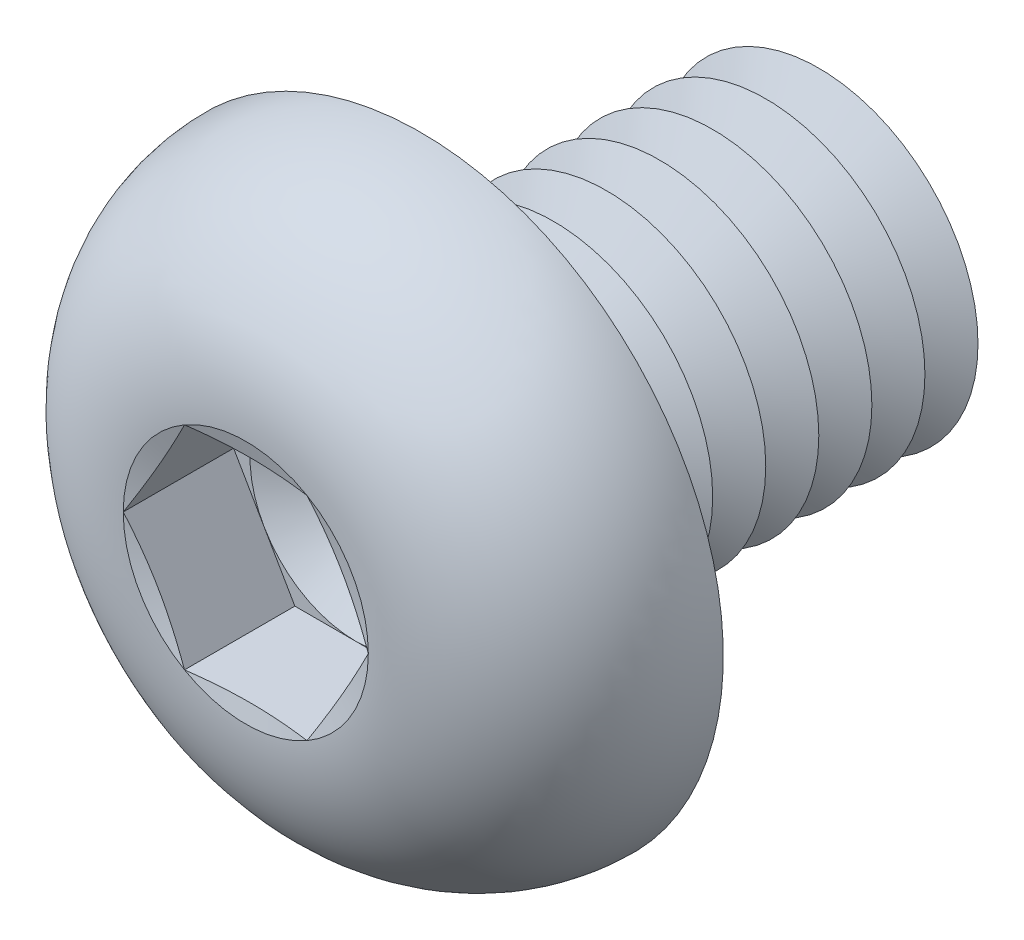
ISO-10303-21;
HEADER;
FILE_DESCRIPTION(('STEP AP214'),'2;1');
FILE_NAME('part.step','',(''),(''),'','','');
FILE_SCHEMA(('AUTOMOTIVE_DESIGN { 1 0 10303 214 1 1 1 1 }'));
ENDSEC;
DATA;
#1=APPLICATION_CONTEXT('core data for automotive mechanical design processes');
#2=APPLICATION_PROTOCOL_DEFINITION('international standard','automotive_design',2000,#1);
#3=PRODUCT_CONTEXT('',#1,'mechanical');
#4=PRODUCT('Part','Part','',(#3));
#5=PRODUCT_RELATED_PRODUCT_CATEGORY('part','',(#4));
#6=PRODUCT_DEFINITION_FORMATION('','',#4);
#7=PRODUCT_DEFINITION_CONTEXT('part definition',#1,'design');
#8=PRODUCT_DEFINITION('design','',#6,#7);
#9=PRODUCT_DEFINITION_SHAPE('','',#8);
#10=(LENGTH_UNIT() NAMED_UNIT(*) SI_UNIT(.MILLI.,.METRE.));
#11=(NAMED_UNIT(*) PLANE_ANGLE_UNIT() SI_UNIT($,.RADIAN.));
#12=(NAMED_UNIT(*) SI_UNIT($,.STERADIAN.) SOLID_ANGLE_UNIT());
#13=UNCERTAINTY_MEASURE_WITH_UNIT(LENGTH_MEASURE(1.E-05),#10,'distance_accuracy_value','');
#14=(GEOMETRIC_REPRESENTATION_CONTEXT(3) GLOBAL_UNCERTAINTY_ASSIGNED_CONTEXT((#13)) GLOBAL_UNIT_ASSIGNED_CONTEXT((#10,
#11,#12)) REPRESENTATION_CONTEXT('',''));
#15=CARTESIAN_POINT('',(0.,0.,0.));
#16=DIRECTION('',(0.,0.,1.));
#17=DIRECTION('',(1.,0.,0.));
#18=AXIS2_PLACEMENT_3D('',#15,#16,#17);
#19=CARTESIAN_POINT('',(0.,0.,0.609999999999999));
#20=DIRECTION('',(0.,0.,1.));
#21=DIRECTION('',(1.,0.,0.));
#22=AXIS2_PLACEMENT_3D('',#19,#20,#21);
#23=PLANE('',#22);
#24=CARTESIAN_POINT('',(0.,0.,0.609999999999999));
#25=DIRECTION('',(0.,0.,1.));
#26=DIRECTION('',(1.,0.,0.));
#27=AXIS2_PLACEMENT_3D('',#24,#25,#26);
#28=CIRCLE('',#27,0.999999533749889);
#29=CARTESIAN_POINT('',(0.866024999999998,0.499999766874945,0.609999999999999));
#30=VERTEX_POINT('',#29);
#31=CARTESIAN_POINT('',(0.,0.999999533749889,0.609999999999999));
#32=VERTEX_POINT('',#31);
#33=EDGE_CURVE('E118',#30,#32,#28,.T.);
#34=ORIENTED_EDGE('',*,*,#33,.F.);
#35=DIRECTION('',(-0.500000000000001,0.866025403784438,0.));
#36=VECTOR('',#35,1.);
#37=CARTESIAN_POINT('',(1.1547,0.,0.609999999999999));
#38=LINE('',#37,#36);
#39=CARTESIAN_POINT('',(0.577349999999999,0.999999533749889,0.609999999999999));
#40=VERTEX_POINT('',#39);
#41=EDGE_CURVE('E125',#30,#40,#38,.T.);
#42=ORIENTED_EDGE('',*,*,#41,.T.);
#43=DIRECTION('',(-1.,0.,0.));
#44=VECTOR('',#43,1.);
#45=CARTESIAN_POINT('',(0.577349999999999,0.999999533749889,0.609999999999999));
#46=LINE('',#45,#44);
#47=EDGE_CURVE('E136',#40,#32,#46,.T.);
#48=ORIENTED_EDGE('',*,*,#47,.T.);
#49=EDGE_LOOP('',(#34,#42,#48));
#50=FACE_BOUND('',#49,.T.);
#51=ADVANCED_FACE('F39',(#50),#23,.T.);
#52=CARTESIAN_POINT('',(0.,0.,0.609999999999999));
#53=DIRECTION('',(0.,0.,1.));
#54=DIRECTION('',(1.,0.,0.));
#55=AXIS2_PLACEMENT_3D('',#52,#53,#54);
#56=CIRCLE('',#55,0.999999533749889);
#57=CARTESIAN_POINT('',(-0.866024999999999,0.499999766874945,0.609999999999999));
#58=VERTEX_POINT('',#57);
#59=EDGE_CURVE('E11',#32,#58,#56,.T.);
#60=ORIENTED_EDGE('',*,*,#59,.F.);
#61=CARTESIAN_POINT('',(-0.577350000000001,0.999999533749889,0.609999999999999));
#62=VERTEX_POINT('',#61);
#63=EDGE_CURVE('E131',#32,#62,#46,.T.);
#64=ORIENTED_EDGE('',*,*,#63,.T.);
#65=DIRECTION('',(-0.5,-0.866025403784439,0.));
#66=VECTOR('',#65,1.);
#67=CARTESIAN_POINT('',(-0.577350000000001,0.999999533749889,0.609999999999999));
#68=LINE('',#67,#66);
#69=EDGE_CURVE('E134',#62,#58,#68,.T.);
#70=ORIENTED_EDGE('',*,*,#69,.T.);
#71=EDGE_LOOP('',(#60,#64,#70));
#72=FACE_BOUND('',#71,.T.);
#73=ADVANCED_FACE('F130',(#72),#23,.T.);
#74=CARTESIAN_POINT('',(-0.866024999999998,-0.499999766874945,0.609999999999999));
#75=VERTEX_POINT('',#74);
#76=EDGE_CURVE('E49',#58,#75,#56,.T.);
#77=ORIENTED_EDGE('',*,*,#76,.F.);
#78=CARTESIAN_POINT('',(-1.1547,0.,0.609999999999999));
#79=VERTEX_POINT('',#78);
#80=EDGE_CURVE('E143',#58,#79,#68,.T.);
#81=ORIENTED_EDGE('',*,*,#80,.T.);
#82=DIRECTION('',(0.5,-0.866025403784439,0.));
#83=VECTOR('',#82,1.);
#84=CARTESIAN_POINT('',(-1.1547,0.,0.609999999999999));
#85=LINE('',#84,#83);
#86=EDGE_CURVE('E152',#79,#75,#85,.T.);
#87=ORIENTED_EDGE('',*,*,#86,.T.);
#88=EDGE_LOOP('',(#77,#81,#87));
#89=FACE_BOUND('',#88,.T.);
#90=ADVANCED_FACE('F330',(#89),#23,.T.);
#91=CARTESIAN_POINT('',(0.,-0.999999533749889,0.609999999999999));
#92=VERTEX_POINT('',#91);
#93=EDGE_CURVE('E316',#75,#92,#56,.T.);
#94=ORIENTED_EDGE('',*,*,#93,.F.);
#95=CARTESIAN_POINT('',(-0.577349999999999,-0.99999953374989,0.609999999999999));
#96=VERTEX_POINT('',#95);
#97=EDGE_CURVE('E151',#75,#96,#85,.T.);
#98=ORIENTED_EDGE('',*,*,#97,.T.);
#99=DIRECTION('',(1.,0.,0.));
#100=VECTOR('',#99,1.);
#101=CARTESIAN_POINT('',(-0.577349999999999,-0.99999953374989,0.609999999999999));
#102=LINE('',#101,#100);
#103=EDGE_CURVE('E157',#96,#92,#102,.T.);
#104=ORIENTED_EDGE('',*,*,#103,.T.);
#105=EDGE_LOOP('',(#94,#98,#104));
#106=FACE_BOUND('',#105,.T.);
#107=ADVANCED_FACE('F323',(#106),#23,.T.);
#108=CARTESIAN_POINT('',(0.866024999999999,-0.499999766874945,0.609999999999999));
#109=VERTEX_POINT('',#108);
#110=EDGE_CURVE('E56',#92,#109,#56,.T.);
#111=ORIENTED_EDGE('',*,*,#110,.F.);
#112=CARTESIAN_POINT('',(0.577349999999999,-0.99999953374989,0.609999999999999));
#113=VERTEX_POINT('',#112);
#114=EDGE_CURVE('E156',#92,#113,#102,.T.);
#115=ORIENTED_EDGE('',*,*,#114,.T.);
#116=DIRECTION('',(0.5,0.866025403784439,0.));
#117=VECTOR('',#116,1.);
#118=CARTESIAN_POINT('',(0.577349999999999,-0.99999953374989,0.609999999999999));
#119=LINE('',#118,#117);
#120=EDGE_CURVE('E162',#113,#109,#119,.T.);
#121=ORIENTED_EDGE('',*,*,#120,.T.);
#122=EDGE_LOOP('',(#111,#115,#121));
#123=FACE_BOUND('',#122,.T.);
#124=ADVANCED_FACE('F404',(#123),#23,.T.);
#125=CARTESIAN_POINT('',(0.,0.,1.65));
#126=DIRECTION('',(0.,0.,1.));
#127=DIRECTION('',(1.,0.,0.));
#128=AXIS2_PLACEMENT_3D('',#125,#126,#127);
#129=CONICAL_SURFACE('',#128,1.1547,1.30899693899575);
#130=CARTESIAN_POINT('',(1.15481547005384,-0.000199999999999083,1.65003094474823));
#131=CARTESIAN_POINT('',(1.13083002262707,0.0413440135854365,1.64359970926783));
#132=CARTESIAN_POINT('',(1.10680107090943,0.0829633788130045,1.63776108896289));
#133=CARTESIAN_POINT('',(1.05865826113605,0.166349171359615,1.62750303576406));
#134=CARTESIAN_POINT('',(1.03454437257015,0.208115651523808,1.62308418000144));
#135=CARTESIAN_POINT('',(0.986377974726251,0.291542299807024,1.61592375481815));
#136=CARTESIAN_POINT('',(0.962325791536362,0.333201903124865,1.61317364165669));
#137=CARTESIAN_POINT('',(0.914190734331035,0.416574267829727,1.60948600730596));
#138=CARTESIAN_POINT('',(0.890107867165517,0.458287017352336,1.60854813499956));
#139=CARTESIAN_POINT('',(0.841942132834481,0.541712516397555,1.60854813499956));
#140=CARTESIAN_POINT('',(0.817859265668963,0.583425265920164,1.60948600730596));
#141=CARTESIAN_POINT('',(0.769724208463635,0.666797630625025,1.61317364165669));
#142=CARTESIAN_POINT('',(0.745672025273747,0.708457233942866,1.61592375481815));
#143=CARTESIAN_POINT('',(0.697505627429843,0.791883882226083,1.62308418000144));
#144=CARTESIAN_POINT('',(0.673391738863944,0.833650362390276,1.62750303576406));
#145=CARTESIAN_POINT('',(0.625248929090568,0.917036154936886,1.63776108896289));
#146=CARTESIAN_POINT('',(0.60121997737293,0.958655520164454,1.64359970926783));
#147=CARTESIAN_POINT('',(0.577234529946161,1.00019953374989,1.65003094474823));
#148=B_SPLINE_CURVE_WITH_KNOTS('',3,(#130,#131,#132,#133,#134,#135,#136,#137,#138,#139,#140,
#141,#142,#143,#144,#145,#146,#147),.UNSPECIFIED.,.F.,.F.,(4,2,2,2,2,2,2,2,4),(0.,
0.145207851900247,0.290474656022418,0.434991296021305,0.579479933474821,0.723968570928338,
0.868485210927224,1.0137520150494,1.15895986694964),.UNSPECIFIED.);
#149=CARTESIAN_POINT('',(1.1547,0.,1.65));
#150=VERTEX_POINT('',#149);
#151=CARTESIAN_POINT('',(0.57735,0.99999953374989,1.65));
#152=VERTEX_POINT('',#151);
#153=EDGE_CURVE('E221',#150,#152,#148,.T.);
#154=ORIENTED_EDGE('',*,*,#153,.F.);
#155=CARTESIAN_POINT('',(0.,0.,1.65));
#156=DIRECTION('',(0.,0.,-1.));
#157=DIRECTION('',(-1.,0.,0.));
#158=AXIS2_PLACEMENT_3D('',#155,#156,#157);
#159=CIRCLE('',#158,1.1547);
#160=EDGE_CURVE('E361',#152,#150,#159,.T.);
#161=ORIENTED_EDGE('',*,*,#160,.F.);
#162=EDGE_LOOP('',(#154,#161));
#163=FACE_BOUND('',#162,.T.);
#164=ADVANCED_FACE('F408',(#163),#129,.F.);
#165=CARTESIAN_POINT('',(0.577234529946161,-1.00019953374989,1.65003094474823));
#166=CARTESIAN_POINT('',(0.60121997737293,-0.958655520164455,1.64359970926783));
#167=CARTESIAN_POINT('',(0.625248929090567,-0.917036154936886,1.63776108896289));
#168=CARTESIAN_POINT('',(0.673391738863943,-0.833650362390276,1.62750303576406));
#169=CARTESIAN_POINT('',(0.697505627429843,-0.791883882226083,1.62308418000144));
#170=CARTESIAN_POINT('',(0.745672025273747,-0.708457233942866,1.61592375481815));
#171=CARTESIAN_POINT('',(0.769724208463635,-0.666797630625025,1.61317364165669));
#172=CARTESIAN_POINT('',(0.817859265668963,-0.583425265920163,1.60948600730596));
#173=CARTESIAN_POINT('',(0.841942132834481,-0.541712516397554,1.60854813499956));
#174=CARTESIAN_POINT('',(0.890107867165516,-0.458287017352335,1.60854813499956));
#175=CARTESIAN_POINT('',(0.914190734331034,-0.416574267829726,1.60948600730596));
#176=CARTESIAN_POINT('',(0.962325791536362,-0.333201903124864,1.61317364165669));
#177=CARTESIAN_POINT('',(0.986377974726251,-0.291542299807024,1.61592375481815));
#178=CARTESIAN_POINT('',(1.03454437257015,-0.208115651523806,1.62308418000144));
#179=CARTESIAN_POINT('',(1.05865826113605,-0.166349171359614,1.62750303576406));
#180=CARTESIAN_POINT('',(1.10680107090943,-0.0829633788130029,1.63776108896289));
#181=CARTESIAN_POINT('',(1.13083002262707,-0.0413440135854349,1.64359970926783));
#182=CARTESIAN_POINT('',(1.15481547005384,0.00020000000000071,1.65003094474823));
#183=B_SPLINE_CURVE_WITH_KNOTS('',3,(#165,#166,#167,#168,#169,#170,#171,#172,#173,#174,#175,
#176,#177,#178,#179,#180,#181,#182),.UNSPECIFIED.,.F.,.F.,(4,2,2,2,2,2,2,2,4),(0.,
0.145207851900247,0.290474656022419,0.434991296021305,0.579479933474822,0.723968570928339,
0.868485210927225,1.0137520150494,1.15895986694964),.UNSPECIFIED.);
#184=CARTESIAN_POINT('',(0.577349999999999,-0.99999953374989,1.65));
#185=VERTEX_POINT('',#184);
#186=EDGE_CURVE('E230',#185,#150,#183,.T.);
#187=ORIENTED_EDGE('',*,*,#186,.F.);
#188=EDGE_CURVE('E363',#150,#185,#159,.T.);
#189=ORIENTED_EDGE('',*,*,#188,.F.);
#190=EDGE_LOOP('',(#187,#189));
#191=FACE_BOUND('',#190,.T.);
#192=ADVANCED_FACE('F369',(#191),#129,.F.);
#193=CARTESIAN_POINT('',(-1.7425668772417,-0.99999953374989,1.87893949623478));
#194=CARTESIAN_POINT('',(-1.65819693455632,-0.99999953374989,1.85935934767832));
#195=CARTESIAN_POINT('',(-1.57375647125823,-0.99999953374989,1.84006351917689));
#196=CARTESIAN_POINT('',(-1.40464514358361,-0.99999953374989,1.80242908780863));
#197=CARTESIAN_POINT('',(-1.31997423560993,-0.99999953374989,1.78409068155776));
#198=CARTESIAN_POINT('',(-1.14955192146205,-0.99999953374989,1.74860242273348));
#199=CARTESIAN_POINT('',(-1.06379782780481,-0.99999953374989,1.73146532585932));
#200=CARTESIAN_POINT('',(-0.891887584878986,-0.99999953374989,1.69925819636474));
#201=CARTESIAN_POINT('',(-0.805731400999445,-0.99999953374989,1.68418834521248));
#202=CARTESIAN_POINT('',(-0.635256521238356,-0.99999953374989,1.65751615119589));
#203=CARTESIAN_POINT('',(-0.550951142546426,-0.99999953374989,1.64583105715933));
#204=CARTESIAN_POINT('',(-0.381865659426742,-0.99999953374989,1.62668811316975));
#205=CARTESIAN_POINT('',(-0.297085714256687,-0.99999953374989,1.61922892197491));
#206=CARTESIAN_POINT('',(-0.127577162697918,-0.99999953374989,1.60981453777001));
#207=CARTESIAN_POINT('',(-0.0428499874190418,-0.99999953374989,1.60783514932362));
#208=CARTESIAN_POINT('',(0.126542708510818,-0.99999953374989,1.60973012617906));
#209=CARTESIAN_POINT('',(0.211208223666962,-0.99999953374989,1.61360496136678));
#210=CARTESIAN_POINT('',(0.356115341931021,-0.99999953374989,1.62460226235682));
#211=CARTESIAN_POINT('',(0.416458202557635,-0.99999953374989,1.63048841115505));
#212=CARTESIAN_POINT('',(0.536893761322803,-0.99999953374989,1.64437752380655));
#213=CARTESIAN_POINT('',(0.596986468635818,-0.99999953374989,1.65238040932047));
#214=CARTESIAN_POINT('',(0.777275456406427,-0.99999953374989,1.67888855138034));
#215=CARTESIAN_POINT('',(0.897104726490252,-0.99999953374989,1.69985858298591));
#216=CARTESIAN_POINT('',(1.07751611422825,-0.99999953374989,1.73433574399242));
#217=CARTESIAN_POINT('',(1.1383777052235,-0.99999953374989,1.74646914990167));
#218=CARTESIAN_POINT('',(1.25994955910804,-0.99999953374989,1.7714845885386));
#219=CARTESIAN_POINT('',(1.32065982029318,-0.99999953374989,1.7843666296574));
#220=CARTESIAN_POINT('',(1.44162663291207,-0.99999953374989,1.81062164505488));
#221=CARTESIAN_POINT('',(1.50188385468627,-0.99999953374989,1.82399156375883));
#222=CARTESIAN_POINT('',(1.62229550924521,-0.99999953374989,1.85116781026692));
#223=CARTESIAN_POINT('',(1.68244994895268,-0.99999953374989,1.86497410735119));
#224=CARTESIAN_POINT('',(1.7425668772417,-0.99999953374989,1.87893949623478));
#225=B_SPLINE_CURVE_WITH_KNOTS('',3,(#193,#194,#195,#196,#197,#198,#199,#200,#201,#202,#203,
#204,#205,#206,#207,#208,#209,#210,#211,#212,#213,#214,#215,#216,#217,#218,#219,#220,#221,#222,
#223,#224),.UNSPECIFIED.,.F.,.F.,(4,2,2,2,2,2,2,2,2,2,2,2,2,2,2,4),(0.,0.259842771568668,
0.519738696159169,0.782071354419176,1.04442702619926,1.29968778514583,1.55486748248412,
1.80891865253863,2.06299021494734,2.24483732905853,2.42667771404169,2.79149503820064,
2.97767344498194,3.16385393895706,3.34902052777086,3.53417411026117),.UNSPECIFIED.);
#226=CARTESIAN_POINT('',(-0.577349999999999,-0.99999953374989,1.65));
#227=VERTEX_POINT('',#226);
#228=EDGE_CURVE('E342',#227,#185,#225,.T.);
#229=ORIENTED_EDGE('',*,*,#228,.F.);
#230=EDGE_CURVE('E350',#185,#227,#159,.T.);
#231=ORIENTED_EDGE('',*,*,#230,.F.);
#232=EDGE_LOOP('',(#229,#231));
#233=FACE_BOUND('',#232,.T.);
#234=ADVANCED_FACE('F375',(#233),#129,.F.);
#235=CARTESIAN_POINT('',(-1.15481547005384,0.000200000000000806,1.65003094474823));
#236=CARTESIAN_POINT('',(-1.13083002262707,-0.0413440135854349,1.64359970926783));
#237=CARTESIAN_POINT('',(-1.10680107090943,-0.082963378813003,1.63776108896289));
#238=CARTESIAN_POINT('',(-1.05865826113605,-0.166349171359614,1.62750303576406));
#239=CARTESIAN_POINT('',(-1.03454437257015,-0.208115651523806,1.62308418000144));
#240=CARTESIAN_POINT('',(-0.986377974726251,-0.291542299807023,1.61592375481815));
#241=CARTESIAN_POINT('',(-0.962325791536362,-0.333201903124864,1.61317364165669));
#242=CARTESIAN_POINT('',(-0.914190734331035,-0.416574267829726,1.60948600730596));
#243=CARTESIAN_POINT('',(-0.890107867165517,-0.458287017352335,1.60854813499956));
#244=CARTESIAN_POINT('',(-0.841942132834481,-0.541712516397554,1.60854813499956));
#245=CARTESIAN_POINT('',(-0.817859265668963,-0.583425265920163,1.60948600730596));
#246=CARTESIAN_POINT('',(-0.769724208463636,-0.666797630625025,1.61317364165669));
#247=CARTESIAN_POINT('',(-0.745672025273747,-0.708457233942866,1.61592375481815));
#248=CARTESIAN_POINT('',(-0.697505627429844,-0.791883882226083,1.62308418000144));
#249=CARTESIAN_POINT('',(-0.673391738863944,-0.833650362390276,1.62750303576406));
#250=CARTESIAN_POINT('',(-0.625248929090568,-0.917036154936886,1.63776108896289));
#251=CARTESIAN_POINT('',(-0.60121997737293,-0.958655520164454,1.64359970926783));
#252=CARTESIAN_POINT('',(-0.577234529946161,-1.00019953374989,1.65003094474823));
#253=B_SPLINE_CURVE_WITH_KNOTS('',3,(#235,#236,#237,#238,#239,#240,#241,#242,#243,#244,#245,
#246,#247,#248,#249,#250,#251,#252),.UNSPECIFIED.,.F.,.F.,(4,2,2,2,2,2,2,2,4),(0.,
0.145207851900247,0.290474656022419,0.434991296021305,0.579479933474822,0.723968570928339,
0.868485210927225,1.0137520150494,1.15895986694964),.UNSPECIFIED.);
#254=CARTESIAN_POINT('',(-1.1547,0.,1.65));
#255=VERTEX_POINT('',#254);
#256=EDGE_CURVE('E335',#255,#227,#253,.T.);
#257=ORIENTED_EDGE('',*,*,#256,.F.);
#258=EDGE_CURVE('E299',#227,#255,#159,.T.);
#259=ORIENTED_EDGE('',*,*,#258,.F.);
#260=EDGE_LOOP('',(#257,#259));
#261=FACE_BOUND('',#260,.T.);
#262=ADVANCED_FACE('F339',(#261),#129,.F.);
#263=CARTESIAN_POINT('',(-0.577234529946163,1.00019953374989,1.65003094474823));
#264=CARTESIAN_POINT('',(-0.601219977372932,0.958655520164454,1.64359970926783));
#265=CARTESIAN_POINT('',(-0.625248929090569,0.917036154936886,1.63776108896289));
#266=CARTESIAN_POINT('',(-0.673391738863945,0.833650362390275,1.62750303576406));
#267=CARTESIAN_POINT('',(-0.697505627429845,0.791883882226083,1.62308418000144));
#268=CARTESIAN_POINT('',(-0.745672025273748,0.708457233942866,1.61592375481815));
#269=CARTESIAN_POINT('',(-0.769724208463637,0.666797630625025,1.61317364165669));
#270=CARTESIAN_POINT('',(-0.817859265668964,0.583425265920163,1.60948600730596));
#271=CARTESIAN_POINT('',(-0.841942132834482,0.541712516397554,1.60854813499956));
#272=CARTESIAN_POINT('',(-0.890107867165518,0.458287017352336,1.60854813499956));
#273=CARTESIAN_POINT('',(-0.914190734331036,0.416574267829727,1.60948600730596));
#274=CARTESIAN_POINT('',(-0.962325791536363,0.333201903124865,1.61317364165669));
#275=CARTESIAN_POINT('',(-0.986377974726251,0.291542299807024,1.61592375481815));
#276=CARTESIAN_POINT('',(-1.03454437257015,0.208115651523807,1.62308418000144));
#277=CARTESIAN_POINT('',(-1.05865826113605,0.166349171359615,1.62750303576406));
#278=CARTESIAN_POINT('',(-1.10680107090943,0.0829633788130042,1.63776108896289));
#279=CARTESIAN_POINT('',(-1.13083002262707,0.0413440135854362,1.64359970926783));
#280=CARTESIAN_POINT('',(-1.15481547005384,-0.000199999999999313,1.65003094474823));
#281=B_SPLINE_CURVE_WITH_KNOTS('',3,(#263,#264,#265,#266,#267,#268,#269,#270,#271,#272,#273,
#274,#275,#276,#277,#278,#279,#280),.UNSPECIFIED.,.F.,.F.,(4,2,2,2,2,2,2,2,4),(0.,
0.145207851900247,0.290474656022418,0.434991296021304,0.579479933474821,0.723968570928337,
0.868485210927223,1.01375201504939,1.15895986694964),.UNSPECIFIED.);
#282=CARTESIAN_POINT('',(-0.577350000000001,0.999999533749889,1.65));
#283=VERTEX_POINT('',#282);
#284=EDGE_CURVE('E195',#283,#255,#281,.T.);
#285=ORIENTED_EDGE('',*,*,#284,.F.);
#286=EDGE_CURVE('E300',#255,#283,#159,.T.);
#287=ORIENTED_EDGE('',*,*,#286,.F.);
#288=EDGE_LOOP('',(#285,#287));
#289=FACE_BOUND('',#288,.T.);
#290=ADVANCED_FACE('F353',(#289),#129,.F.);
#291=CARTESIAN_POINT('',(0.,0.,-2.25));
#292=DIRECTION('',(0.,0.,1.));
#293=DIRECTION('',(1.,0.,0.));
#294=AXIS2_PLACEMENT_3D('',#291,#292,#293);
#295=CONICAL_SURFACE('',#294,1.5,1.0471975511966);
#296=CARTESIAN_POINT('',(0.,0.,-2.5));
#297=DIRECTION('',(0.,0.,1.));
#298=DIRECTION('',(1.,0.,0.));
#299=AXIS2_PLACEMENT_3D('',#296,#297,#298);
#300=CIRCLE('',#299,1.06698729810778);
#301=CARTESIAN_POINT('',(1.06698729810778,0.,-2.5));
#302=VERTEX_POINT('',#301);
#303=EDGE_CURVE('E271',#302,#302,#300,.T.);
#304=ORIENTED_EDGE('',*,*,#303,.T.);
#305=EDGE_LOOP('',(#304));
#306=FACE_BOUND('',#305,.T.);
#307=CARTESIAN_POINT('',(0.,0.,-2.25));
#308=DIRECTION('',(0.,0.,1.));
#309=DIRECTION('',(1.,0.,0.));
#310=AXIS2_PLACEMENT_3D('',#307,#308,#309);
#311=CIRCLE('',#310,1.5);
#312=CARTESIAN_POINT('',(1.5,0.,-2.25));
#313=VERTEX_POINT('',#312);
#314=EDGE_CURVE('E267',#313,#313,#311,.T.);
#315=ORIENTED_EDGE('',*,*,#314,.F.);
#316=EDGE_LOOP('',(#315));
#317=FACE_BOUND('',#316,.T.);
#318=ADVANCED_FACE('F542',(#306,#317),#295,.T.);
#319=CARTESIAN_POINT('',(0.,0.,-2.5));
#320=DIRECTION('',(0.,0.,-1.));
#321=DIRECTION('',(-1.,0.,0.));
#322=AXIS2_PLACEMENT_3D('',#319,#320,#321);
#323=CONICAL_SURFACE('',#322,1.06698729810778,1.0471975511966);
#324=CARTESIAN_POINT('',(0.,0.,-2.75));
#325=DIRECTION('',(0.,0.,1.));
#326=DIRECTION('',(1.,0.,0.));
#327=AXIS2_PLACEMENT_3D('',#324,#325,#326);
#328=CIRCLE('',#327,1.5);
#329=CARTESIAN_POINT('',(1.5,0.,-2.75));
#330=VERTEX_POINT('',#329);
#331=EDGE_CURVE('E275',#330,#330,#328,.T.);
#332=ORIENTED_EDGE('',*,*,#331,.T.);
#333=EDGE_LOOP('',(#332));
#334=FACE_BOUND('',#333,.T.);
#335=ORIENTED_EDGE('',*,*,#303,.F.);
#336=EDGE_LOOP('',(#335));
#337=FACE_BOUND('',#336,.T.);
#338=ADVANCED_FACE('F664',(#334,#337),#323,.T.);
#339=CARTESIAN_POINT('',(0.,1.5,-4.));
#340=DIRECTION('',(0.,0.,-1.));
#341=DIRECTION('',(-1.,0.,0.));
#342=AXIS2_PLACEMENT_3D('',#339,#340,#341);
#343=PLANE('',#342);
#344=CARTESIAN_POINT('',(0.,0.,-4.));
#345=DIRECTION('',(0.,0.,1.));
#346=DIRECTION('',(1.,0.,0.));
#347=AXIS2_PLACEMENT_3D('',#344,#345,#346);
#348=CIRCLE('',#347,1.06698729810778);
#349=CARTESIAN_POINT('',(1.06698729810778,0.,-4.));
#350=VERTEX_POINT('',#349);
#351=EDGE_CURVE('E295',#350,#350,#348,.T.);
#352=ORIENTED_EDGE('',*,*,#351,.F.);
#353=EDGE_LOOP('',(#352));
#354=FACE_BOUND('',#353,.T.);
#355=ADVANCED_FACE('F669',(#354),#343,.T.);
#356=CARTESIAN_POINT('',(0.,0.,-3.75));
#357=DIRECTION('',(0.,0.,1.));
#358=DIRECTION('',(1.,0.,0.));
#359=AXIS2_PLACEMENT_3D('',#356,#357,#358);
#360=CONICAL_SURFACE('',#359,1.5,1.0471975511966);
#361=ORIENTED_EDGE('',*,*,#351,.T.);
#362=EDGE_LOOP('',(#361));
#363=FACE_BOUND('',#362,.T.);
#364=CARTESIAN_POINT('',(0.,0.,-3.75));
#365=DIRECTION('',(0.,0.,1.));
#366=DIRECTION('',(1.,0.,0.));
#367=AXIS2_PLACEMENT_3D('',#364,#365,#366);
#368=CIRCLE('',#367,1.5);
#369=CARTESIAN_POINT('',(1.5,0.,-3.75));
#370=VERTEX_POINT('',#369);
#371=EDGE_CURVE('E291',#370,#370,#368,.T.);
#372=ORIENTED_EDGE('',*,*,#371,.F.);
#373=EDGE_LOOP('',(#372));
#374=FACE_BOUND('',#373,.T.);
#375=ADVANCED_FACE('F658',(#363,#374),#360,.T.);
#376=CARTESIAN_POINT('',(0.,0.,-3.5));
#377=DIRECTION('',(0.,0.,-1.));
#378=DIRECTION('',(-1.,0.,0.));
#379=AXIS2_PLACEMENT_3D('',#376,#377,#378);
#380=CONICAL_SURFACE('',#379,1.06698729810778,1.0471975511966);
#381=ORIENTED_EDGE('',*,*,#371,.T.);
#382=EDGE_LOOP('',(#381));
#383=FACE_BOUND('',#382,.T.);
#384=CARTESIAN_POINT('',(0.,0.,-3.5));
#385=DIRECTION('',(0.,0.,1.));
#386=DIRECTION('',(1.,0.,0.));
#387=AXIS2_PLACEMENT_3D('',#384,#385,#386);
#388=CIRCLE('',#387,1.06698729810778);
#389=CARTESIAN_POINT('',(1.06698729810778,0.,-3.5));
#390=VERTEX_POINT('',#389);
#391=EDGE_CURVE('E287',#390,#390,#388,.T.);
#392=ORIENTED_EDGE('',*,*,#391,.F.);
#393=EDGE_LOOP('',(#392));
#394=FACE_BOUND('',#393,.T.);
#395=ADVANCED_FACE('F648',(#383,#394),#380,.T.);
#396=CARTESIAN_POINT('',(0.,0.,-3.25));
#397=DIRECTION('',(0.,0.,1.));
#398=DIRECTION('',(1.,0.,0.));
#399=AXIS2_PLACEMENT_3D('',#396,#397,#398);
#400=CONICAL_SURFACE('',#399,1.5,1.0471975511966);
#401=ORIENTED_EDGE('',*,*,#391,.T.);
#402=EDGE_LOOP('',(#401));
#403=FACE_BOUND('',#402,.T.);
#404=CARTESIAN_POINT('',(0.,0.,-3.25));
#405=DIRECTION('',(0.,0.,1.));
#406=DIRECTION('',(1.,0.,0.));
#407=AXIS2_PLACEMENT_3D('',#404,#405,#406);
#408=CIRCLE('',#407,1.5);
#409=CARTESIAN_POINT('',(1.5,0.,-3.25));
#410=VERTEX_POINT('',#409);
#411=EDGE_CURVE('E283',#410,#410,#408,.T.);
#412=ORIENTED_EDGE('',*,*,#411,.F.);
#413=EDGE_LOOP('',(#412));
#414=FACE_BOUND('',#413,.T.);
#415=ADVANCED_FACE('F638',(#403,#414),#400,.T.);
#416=CARTESIAN_POINT('',(0.,0.,-3.));
#417=DIRECTION('',(0.,0.,-1.));
#418=DIRECTION('',(-1.,0.,0.));
#419=AXIS2_PLACEMENT_3D('',#416,#417,#418);
#420=CONICAL_SURFACE('',#419,1.06698729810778,1.0471975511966);
#421=ORIENTED_EDGE('',*,*,#411,.T.);
#422=EDGE_LOOP('',(#421));
#423=FACE_BOUND('',#422,.T.);
#424=CARTESIAN_POINT('',(0.,0.,-3.));
#425=DIRECTION('',(0.,0.,1.));
#426=DIRECTION('',(1.,0.,0.));
#427=AXIS2_PLACEMENT_3D('',#424,#425,#426);
#428=CIRCLE('',#427,1.06698729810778);
#429=CARTESIAN_POINT('',(1.06698729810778,0.,-3.));
#430=VERTEX_POINT('',#429);
#431=EDGE_CURVE('E279',#430,#430,#428,.T.);
#432=ORIENTED_EDGE('',*,*,#431,.F.);
#433=EDGE_LOOP('',(#432));
#434=FACE_BOUND('',#433,.T.);
#435=ADVANCED_FACE('F628',(#423,#434),#420,.T.);
#436=CARTESIAN_POINT('',(0.,0.,-2.75));
#437=DIRECTION('',(0.,0.,1.));
#438=DIRECTION('',(1.,0.,0.));
#439=AXIS2_PLACEMENT_3D('',#436,#437,#438);
#440=CONICAL_SURFACE('',#439,1.5,1.0471975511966);
#441=ORIENTED_EDGE('',*,*,#431,.T.);
#442=EDGE_LOOP('',(#441));
#443=FACE_BOUND('',#442,.T.);
#444=ORIENTED_EDGE('',*,*,#331,.F.);
#445=EDGE_LOOP('',(#444));
#446=FACE_BOUND('',#445,.T.);
#447=ADVANCED_FACE('F618',(#443,#446),#440,.T.);
#448=CARTESIAN_POINT('',(0.,0.,-1.75));
#449=DIRECTION('',(0.,0.,1.));
#450=DIRECTION('',(1.,0.,0.));
#451=AXIS2_PLACEMENT_3D('',#448,#449,#450);
#452=CONICAL_SURFACE('',#451,1.5,1.0471975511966);
#453=CARTESIAN_POINT('',(0.,0.,-2.));
#454=DIRECTION('',(0.,0.,1.));
#455=DIRECTION('',(1.,0.,0.));
#456=AXIS2_PLACEMENT_3D('',#453,#454,#455);
#457=CIRCLE('',#456,1.06698729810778);
#458=CARTESIAN_POINT('',(1.06698729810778,0.,-2.));
#459=VERTEX_POINT('',#458);
#460=EDGE_CURVE('E263',#459,#459,#457,.T.);
#461=ORIENTED_EDGE('',*,*,#460,.T.);
#462=EDGE_LOOP('',(#461));
#463=FACE_BOUND('',#462,.T.);
#464=CARTESIAN_POINT('',(0.,0.,-1.75));
#465=DIRECTION('',(0.,0.,1.));
#466=DIRECTION('',(1.,0.,0.));
#467=AXIS2_PLACEMENT_3D('',#464,#465,#466);
#468=CIRCLE('',#467,1.5);
#469=CARTESIAN_POINT('',(1.5,0.,-1.75));
#470=VERTEX_POINT('',#469);
#471=EDGE_CURVE('E259',#470,#470,#468,.T.);
#472=ORIENTED_EDGE('',*,*,#471,.F.);
#473=EDGE_LOOP('',(#472));
#474=FACE_BOUND('',#473,.T.);
#475=ADVANCED_FACE('F608',(#463,#474),#452,.T.);
#476=CARTESIAN_POINT('',(0.,0.,-2.));
#477=DIRECTION('',(0.,0.,-1.));
#478=DIRECTION('',(-1.,0.,0.));
#479=AXIS2_PLACEMENT_3D('',#476,#477,#478);
#480=CONICAL_SURFACE('',#479,1.06698729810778,1.0471975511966);
#481=ORIENTED_EDGE('',*,*,#314,.T.);
#482=EDGE_LOOP('',(#481));
#483=FACE_BOUND('',#482,.T.);
#484=ORIENTED_EDGE('',*,*,#460,.F.);
#485=EDGE_LOOP('',(#484));
#486=FACE_BOUND('',#485,.T.);
#487=ADVANCED_FACE('F598',(#483,#486),#480,.T.);
#488=CARTESIAN_POINT('',(0.,0.,-1.25));
#489=DIRECTION('',(0.,0.,1.));
#490=DIRECTION('',(1.,0.,0.));
#491=AXIS2_PLACEMENT_3D('',#488,#489,#490);
#492=CONICAL_SURFACE('',#491,1.5,1.0471975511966);
#493=CARTESIAN_POINT('',(0.,0.,-1.5));
#494=DIRECTION('',(0.,0.,1.));
#495=DIRECTION('',(1.,0.,0.));
#496=AXIS2_PLACEMENT_3D('',#493,#494,#495);
#497=CIRCLE('',#496,1.06698729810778);
#498=CARTESIAN_POINT('',(1.06698729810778,0.,-1.5));
#499=VERTEX_POINT('',#498);
#500=EDGE_CURVE('E255',#499,#499,#497,.T.);
#501=ORIENTED_EDGE('',*,*,#500,.T.);
#502=EDGE_LOOP('',(#501));
#503=FACE_BOUND('',#502,.T.);
#504=CARTESIAN_POINT('',(0.,0.,-1.25));
#505=DIRECTION('',(0.,0.,1.));
#506=DIRECTION('',(1.,0.,0.));
#507=AXIS2_PLACEMENT_3D('',#504,#505,#506);
#508=CIRCLE('',#507,1.5);
#509=CARTESIAN_POINT('',(1.5,0.,-1.25));
#510=VERTEX_POINT('',#509);
#511=EDGE_CURVE('E251',#510,#510,#508,.T.);
#512=ORIENTED_EDGE('',*,*,#511,.F.);
#513=EDGE_LOOP('',(#512));
#514=FACE_BOUND('',#513,.T.);
#515=ADVANCED_FACE('F588',(#503,#514),#492,.T.);
#516=CARTESIAN_POINT('',(0.,0.,-1.5));
#517=DIRECTION('',(0.,0.,-1.));
#518=DIRECTION('',(-1.,0.,0.));
#519=AXIS2_PLACEMENT_3D('',#516,#517,#518);
#520=CONICAL_SURFACE('',#519,1.06698729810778,1.0471975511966);
#521=ORIENTED_EDGE('',*,*,#471,.T.);
#522=EDGE_LOOP('',(#521));
#523=FACE_BOUND('',#522,.T.);
#524=ORIENTED_EDGE('',*,*,#500,.F.);
#525=EDGE_LOOP('',(#524));
#526=FACE_BOUND('',#525,.T.);
#527=ADVANCED_FACE('F578',(#523,#526),#520,.T.);
#528=CARTESIAN_POINT('',(0.,0.,-0.75));
#529=DIRECTION('',(0.,0.,1.));
#530=DIRECTION('',(1.,0.,0.));
#531=AXIS2_PLACEMENT_3D('',#528,#529,#530);
#532=CONICAL_SURFACE('',#531,1.5,1.0471975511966);
#533=CARTESIAN_POINT('',(0.,0.,-1.));
#534=DIRECTION('',(0.,0.,1.));
#535=DIRECTION('',(1.,0.,0.));
#536=AXIS2_PLACEMENT_3D('',#533,#534,#535);
#537=CIRCLE('',#536,1.06698729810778);
#538=CARTESIAN_POINT('',(1.06698729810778,0.,-1.));
#539=VERTEX_POINT('',#538);
#540=EDGE_CURVE('E247',#539,#539,#537,.T.);
#541=ORIENTED_EDGE('',*,*,#540,.T.);
#542=EDGE_LOOP('',(#541));
#543=FACE_BOUND('',#542,.T.);
#544=CARTESIAN_POINT('',(0.,0.,-0.75));
#545=DIRECTION('',(0.,0.,1.));
#546=DIRECTION('',(1.,0.,0.));
#547=AXIS2_PLACEMENT_3D('',#544,#545,#546);
#548=CIRCLE('',#547,1.5);
#549=CARTESIAN_POINT('',(1.5,0.,-0.75));
#550=VERTEX_POINT('',#549);
#551=EDGE_CURVE('E240',#550,#550,#548,.T.);
#552=ORIENTED_EDGE('',*,*,#551,.F.);
#553=EDGE_LOOP('',(#552));
#554=FACE_BOUND('',#553,.T.);
#555=ADVANCED_FACE('F568',(#543,#554),#532,.T.);
#556=CARTESIAN_POINT('',(0.,0.,-1.));
#557=DIRECTION('',(0.,0.,-1.));
#558=DIRECTION('',(-1.,0.,0.));
#559=AXIS2_PLACEMENT_3D('',#556,#557,#558);
#560=CONICAL_SURFACE('',#559,1.06698729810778,1.0471975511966);
#561=ORIENTED_EDGE('',*,*,#511,.T.);
#562=EDGE_LOOP('',(#561));
#563=FACE_BOUND('',#562,.T.);
#564=ORIENTED_EDGE('',*,*,#540,.F.);
#565=EDGE_LOOP('',(#564));
#566=FACE_BOUND('',#565,.T.);
#567=ADVANCED_FACE('F559',(#563,#566),#560,.T.);
#568=CARTESIAN_POINT('',(0.,0.,-0.25));
#569=DIRECTION('',(0.,0.,1.));
#570=DIRECTION('',(1.,0.,0.));
#571=AXIS2_PLACEMENT_3D('',#568,#569,#570);
#572=CONICAL_SURFACE('',#571,1.5,1.0471975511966);
#573=CARTESIAN_POINT('',(0.,0.,-0.5));
#574=DIRECTION('',(0.,0.,1.));
#575=DIRECTION('',(1.,0.,0.));
#576=AXIS2_PLACEMENT_3D('',#573,#574,#575);
#577=CIRCLE('',#576,1.06698729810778);
#578=CARTESIAN_POINT('',(1.06698729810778,0.,-0.5));
#579=VERTEX_POINT('',#578);
#580=EDGE_CURVE('E229',#579,#579,#577,.T.);
#581=ORIENTED_EDGE('',*,*,#580,.T.);
#582=EDGE_LOOP('',(#581));
#583=FACE_BOUND('',#582,.T.);
#584=CARTESIAN_POINT('',(0.,0.,-0.25));
#585=DIRECTION('',(0.,0.,1.));
#586=DIRECTION('',(1.,0.,0.));
#587=AXIS2_PLACEMENT_3D('',#584,#585,#586);
#588=CIRCLE('',#587,1.5);
#589=CARTESIAN_POINT('',(1.5,0.,-0.25));
#590=VERTEX_POINT('',#589);
#591=EDGE_CURVE('E243',#590,#590,#588,.T.);
#592=ORIENTED_EDGE('',*,*,#591,.F.);
#593=EDGE_LOOP('',(#592));
#594=FACE_BOUND('',#593,.T.);
#595=ADVANCED_FACE('F550',(#583,#594),#572,.T.);
#596=CARTESIAN_POINT('',(0.,0.,-0.5));
#597=DIRECTION('',(0.,0.,-1.));
#598=DIRECTION('',(-1.,0.,0.));
#599=AXIS2_PLACEMENT_3D('',#596,#597,#598);
#600=CONICAL_SURFACE('',#599,1.06698729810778,1.0471975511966);
#601=ORIENTED_EDGE('',*,*,#551,.T.);
#602=EDGE_LOOP('',(#601));
#603=FACE_BOUND('',#602,.T.);
#604=ORIENTED_EDGE('',*,*,#580,.F.);
#605=EDGE_LOOP('',(#604));
#606=FACE_BOUND('',#605,.T.);
#607=ADVANCED_FACE('F218',(#603,#606),#600,.T.);
#608=CARTESIAN_POINT('',(1.7425668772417,0.999999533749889,1.87893949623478));
#609=CARTESIAN_POINT('',(1.65819693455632,0.999999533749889,1.85935934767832));
#610=CARTESIAN_POINT('',(1.57375647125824,0.999999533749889,1.84006351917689));
#611=CARTESIAN_POINT('',(1.40464514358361,0.999999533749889,1.80242908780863));
#612=CARTESIAN_POINT('',(1.31997423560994,0.999999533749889,1.78409068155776));
#613=CARTESIAN_POINT('',(1.14955192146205,0.999999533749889,1.74860242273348));
#614=CARTESIAN_POINT('',(1.06379782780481,0.999999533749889,1.73146532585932));
#615=CARTESIAN_POINT('',(0.891887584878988,0.999999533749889,1.69925819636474));
#616=CARTESIAN_POINT('',(0.805731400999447,0.999999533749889,1.68418834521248));
#617=CARTESIAN_POINT('',(0.635256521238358,0.999999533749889,1.65751615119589));
#618=CARTESIAN_POINT('',(0.550951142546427,0.999999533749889,1.64583105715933));
#619=CARTESIAN_POINT('',(0.381865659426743,0.999999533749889,1.62668811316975));
#620=CARTESIAN_POINT('',(0.297085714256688,0.999999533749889,1.61922892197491));
#621=CARTESIAN_POINT('',(0.127577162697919,0.999999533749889,1.60981453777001));
#622=CARTESIAN_POINT('',(0.0428499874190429,0.999999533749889,1.60783514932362));
#623=CARTESIAN_POINT('',(-0.126542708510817,0.999999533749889,1.60973012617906));
#624=CARTESIAN_POINT('',(-0.211208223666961,0.999999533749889,1.61360496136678));
#625=CARTESIAN_POINT('',(-0.35611534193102,0.999999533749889,1.62460226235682));
#626=CARTESIAN_POINT('',(-0.416458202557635,0.999999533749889,1.63048841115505));
#627=CARTESIAN_POINT('',(-0.536893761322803,0.999999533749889,1.64437752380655));
#628=CARTESIAN_POINT('',(-0.596986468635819,0.999999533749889,1.65238040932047));
#629=CARTESIAN_POINT('',(-0.777275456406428,0.999999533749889,1.67888855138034));
#630=CARTESIAN_POINT('',(-0.897104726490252,0.999999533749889,1.69985858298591));
#631=CARTESIAN_POINT('',(-1.07751611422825,0.999999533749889,1.73433574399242));
#632=CARTESIAN_POINT('',(-1.1383777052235,0.999999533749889,1.74646914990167));
#633=CARTESIAN_POINT('',(-1.25994955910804,0.999999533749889,1.7714845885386));
#634=CARTESIAN_POINT('',(-1.32065982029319,0.999999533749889,1.7843666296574));
#635=CARTESIAN_POINT('',(-1.44162663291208,0.999999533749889,1.81062164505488));
#636=CARTESIAN_POINT('',(-1.50188385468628,0.999999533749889,1.82399156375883));
#637=CARTESIAN_POINT('',(-1.62229550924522,0.999999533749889,1.85116781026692));
#638=CARTESIAN_POINT('',(-1.68244994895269,0.999999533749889,1.86497410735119));
#639=CARTESIAN_POINT('',(-1.7425668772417,0.999999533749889,1.87893949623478));
#640=B_SPLINE_CURVE_WITH_KNOTS('',3,(#608,#609,#610,#611,#612,#613,#614,#615,#616,#617,#618,
#619,#620,#621,#622,#623,#624,#625,#626,#627,#628,#629,#630,#631,#632,#633,#634,#635,#636,#637,
#638,#639),.UNSPECIFIED.,.F.,.F.,(4,2,2,2,2,2,2,2,2,2,2,2,2,2,2,4),(0.,0.259842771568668,
0.519738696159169,0.782071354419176,1.04442702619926,1.29968778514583,1.55486748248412,
1.80891865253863,2.06299021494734,2.24483732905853,2.42667771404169,2.79149503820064,
2.97767344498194,3.16385393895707,3.34902052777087,3.53417411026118),.UNSPECIFIED.);
#641=EDGE_CURVE('E170',#152,#283,#640,.T.);
#642=ORIENTED_EDGE('',*,*,#641,.F.);
#643=EDGE_CURVE('E305',#283,#152,#159,.T.);
#644=ORIENTED_EDGE('',*,*,#643,.F.);
#645=EDGE_LOOP('',(#642,#644));
#646=FACE_BOUND('',#645,.T.);
#647=ADVANCED_FACE('F202',(#646),#129,.F.);
#648=CARTESIAN_POINT('',(0.,0.,0.));
#649=DIRECTION('',(0.,0.,-1.));
#650=DIRECTION('',(-1.,0.,0.));
#651=AXIS2_PLACEMENT_3D('',#648,#649,#650);
#652=DEGENERATE_TOROIDAL_SURFACE('',#651,1.19939477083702,1.65060522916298,.T.);
#653=ORIENTED_EDGE('',*,*,#286,.T.);
#654=ORIENTED_EDGE('',*,*,#643,.T.);
#655=ORIENTED_EDGE('',*,*,#160,.T.);
#656=ORIENTED_EDGE('',*,*,#188,.T.);
#657=ORIENTED_EDGE('',*,*,#230,.T.);
#658=ORIENTED_EDGE('',*,*,#258,.T.);
#659=EDGE_LOOP('',(#653,#654,#655,#656,#657,#658));
#660=FACE_BOUND('',#659,.T.);
#661=CARTESIAN_POINT('',(0.,0.,0.));
#662=DIRECTION('',(0.,0.,-1.));
#663=DIRECTION('',(-1.,0.,0.));
#664=AXIS2_PLACEMENT_3D('',#661,#662,#663);
#665=CIRCLE('',#664,2.85);
#666=CARTESIAN_POINT('',(-2.85,0.,0.));
#667=VERTEX_POINT('',#666);
#668=EDGE_CURVE('E304',#667,#667,#665,.T.);
#669=ORIENTED_EDGE('',*,*,#668,.F.);
#670=EDGE_LOOP('',(#669));
#671=FACE_BOUND('',#670,.T.);
#672=ADVANCED_FACE('F345',(#660,#671),#652,.T.);
#673=CARTESIAN_POINT('',(0.,1.5,0.));
#674=DIRECTION('',(0.,0.,-1.));
#675=DIRECTION('',(-1.,0.,0.));
#676=AXIS2_PLACEMENT_3D('',#673,#674,#675);
#677=PLANE('',#676);
#678=CARTESIAN_POINT('',(0.,0.,0.));
#679=DIRECTION('',(0.,0.,-1.));
#680=DIRECTION('',(-1.,0.,0.));
#681=AXIS2_PLACEMENT_3D('',#678,#679,#680);
#682=CIRCLE('',#681,1.75);
#683=CARTESIAN_POINT('',(-1.75,0.,0.));
#684=VERTEX_POINT('',#683);
#685=EDGE_CURVE('E308',#684,#684,#682,.F.);
#686=ORIENTED_EDGE('',*,*,#685,.T.);
#687=EDGE_LOOP('',(#686));
#688=FACE_BOUND('',#687,.T.);
#689=ORIENTED_EDGE('',*,*,#668,.T.);
#690=EDGE_LOOP('',(#689));
#691=FACE_BOUND('',#690,.T.);
#692=ADVANCED_FACE('F704',(#688,#691),#677,.T.);
#693=CARTESIAN_POINT('',(0.,0.,-0.25));
#694=DIRECTION('',(0.,0.,-1.));
#695=DIRECTION('',(-1.,0.,0.));
#696=AXIS2_PLACEMENT_3D('',#693,#694,#695);
#697=TOROIDAL_SURFACE('',#696,1.75,0.25);
#698=ORIENTED_EDGE('',*,*,#685,.F.);
#699=EDGE_LOOP('',(#698));
#700=FACE_BOUND('',#699,.T.);
#701=ORIENTED_EDGE('',*,*,#591,.T.);
#702=EDGE_LOOP('',(#701));
#703=FACE_BOUND('',#702,.T.);
#704=ADVANCED_FACE('F41',(#700,#703),#697,.F.);
#705=CARTESIAN_POINT('',(1.1547,0.,0.609999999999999));
#706=DIRECTION('',(0.866025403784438,0.500000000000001,0.));
#707=DIRECTION('',(-0.500000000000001,0.866025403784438,0.));
#708=AXIS2_PLACEMENT_3D('',#705,#706,#707);
#709=PLANE('',#708);
#710=ORIENTED_EDGE('',*,*,#153,.T.);
#711=DIRECTION('',(0.,0.,1.));
#712=VECTOR('',#711,1.);
#713=CARTESIAN_POINT('',(0.577349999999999,0.999999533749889,0.609999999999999));
#714=LINE('',#713,#712);
#715=EDGE_CURVE('E64',#40,#152,#714,.T.);
#716=ORIENTED_EDGE('',*,*,#715,.F.);
#717=ORIENTED_EDGE('',*,*,#41,.F.);
#718=CARTESIAN_POINT('',(1.1547,0.,0.609999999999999));
#719=VERTEX_POINT('',#718);
#720=EDGE_CURVE('E140',#719,#30,#38,.T.);
#721=ORIENTED_EDGE('',*,*,#720,.F.);
#722=DIRECTION('',(0.,0.,1.));
#723=VECTOR('',#722,1.);
#724=CARTESIAN_POINT('',(1.1547,0.,0.609999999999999));
#725=LINE('',#724,#723);
#726=EDGE_CURVE('E166',#719,#150,#725,.T.);
#727=ORIENTED_EDGE('',*,*,#726,.T.);
#728=EDGE_LOOP('',(#710,#716,#717,#721,#727));
#729=FACE_BOUND('',#728,.T.);
#730=ADVANCED_FACE('F212',(#729),#709,.F.);
#731=CARTESIAN_POINT('',(0.577349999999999,-0.99999953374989,0.609999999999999));
#732=DIRECTION('',(0.866025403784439,-0.5,0.));
#733=DIRECTION('',(0.5,0.866025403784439,0.));
#734=AXIS2_PLACEMENT_3D('',#731,#732,#733);
#735=PLANE('',#734);
#736=ORIENTED_EDGE('',*,*,#186,.T.);
#737=ORIENTED_EDGE('',*,*,#726,.F.);
#738=EDGE_CURVE('E161',#109,#719,#119,.T.);
#739=ORIENTED_EDGE('',*,*,#738,.F.);
#740=ORIENTED_EDGE('',*,*,#120,.F.);
#741=DIRECTION('',(0.,0.,1.));
#742=VECTOR('',#741,1.);
#743=CARTESIAN_POINT('',(0.577349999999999,-0.99999953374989,0.609999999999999));
#744=LINE('',#743,#742);
#745=EDGE_CURVE('E171',#113,#185,#744,.T.);
#746=ORIENTED_EDGE('',*,*,#745,.T.);
#747=EDGE_LOOP('',(#736,#737,#739,#740,#746));
#748=FACE_BOUND('',#747,.T.);
#749=ADVANCED_FACE('F216',(#748),#735,.F.);
#750=CARTESIAN_POINT('',(-0.577349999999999,-0.99999953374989,0.609999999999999));
#751=DIRECTION('',(0.,-1.,0.));
#752=DIRECTION('',(0.,0.,-1.));
#753=AXIS2_PLACEMENT_3D('',#750,#751,#752);
#754=PLANE('',#753);
#755=ORIENTED_EDGE('',*,*,#228,.T.);
#756=ORIENTED_EDGE('',*,*,#745,.F.);
#757=ORIENTED_EDGE('',*,*,#114,.F.);
#758=ORIENTED_EDGE('',*,*,#103,.F.);
#759=DIRECTION('',(0.,0.,1.));
#760=VECTOR('',#759,1.);
#761=CARTESIAN_POINT('',(-0.577349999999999,-0.99999953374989,0.609999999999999));
#762=LINE('',#761,#760);
#763=EDGE_CURVE('E175',#96,#227,#762,.T.);
#764=ORIENTED_EDGE('',*,*,#763,.T.);
#765=EDGE_LOOP('',(#755,#756,#757,#758,#764));
#766=FACE_BOUND('',#765,.T.);
#767=ADVANCED_FACE('F388',(#766),#754,.F.);
#768=CARTESIAN_POINT('',(-1.1547,0.,0.609999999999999));
#769=DIRECTION('',(-0.866025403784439,-0.5,0.));
#770=DIRECTION('',(0.5,-0.866025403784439,0.));
#771=AXIS2_PLACEMENT_3D('',#768,#769,#770);
#772=PLANE('',#771);
#773=ORIENTED_EDGE('',*,*,#256,.T.);
#774=ORIENTED_EDGE('',*,*,#763,.F.);
#775=ORIENTED_EDGE('',*,*,#97,.F.);
#776=ORIENTED_EDGE('',*,*,#86,.F.);
#777=DIRECTION('',(0.,0.,1.));
#778=VECTOR('',#777,1.);
#779=CARTESIAN_POINT('',(-1.1547,0.,0.609999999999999));
#780=LINE('',#779,#778);
#781=EDGE_CURVE('E179',#79,#255,#780,.T.);
#782=ORIENTED_EDGE('',*,*,#781,.T.);
#783=EDGE_LOOP('',(#773,#774,#775,#776,#782));
#784=FACE_BOUND('',#783,.T.);
#785=ADVANCED_FACE('F328',(#784),#772,.F.);
#786=CARTESIAN_POINT('',(-0.577350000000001,0.999999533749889,0.609999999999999));
#787=DIRECTION('',(-0.866025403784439,0.5,0.));
#788=DIRECTION('',(-0.5,-0.866025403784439,0.));
#789=AXIS2_PLACEMENT_3D('',#786,#787,#788);
#790=PLANE('',#789);
#791=ORIENTED_EDGE('',*,*,#284,.T.);
#792=ORIENTED_EDGE('',*,*,#781,.F.);
#793=ORIENTED_EDGE('',*,*,#80,.F.);
#794=ORIENTED_EDGE('',*,*,#69,.F.);
#795=DIRECTION('',(0.,0.,1.));
#796=VECTOR('',#795,1.);
#797=CARTESIAN_POINT('',(-0.577350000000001,0.999999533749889,0.609999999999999));
#798=LINE('',#797,#796);
#799=EDGE_CURVE('E138',#62,#283,#798,.T.);
#800=ORIENTED_EDGE('',*,*,#799,.T.);
#801=EDGE_LOOP('',(#791,#792,#793,#794,#800));
#802=FACE_BOUND('',#801,.T.);
#803=ADVANCED_FACE('F209',(#802),#790,.F.);
#804=CARTESIAN_POINT('',(0.577349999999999,0.999999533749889,0.609999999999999));
#805=DIRECTION('',(0.,1.,0.));
#806=DIRECTION('',(0.,0.,1.));
#807=AXIS2_PLACEMENT_3D('',#804,#805,#806);
#808=PLANE('',#807);
#809=ORIENTED_EDGE('',*,*,#641,.T.);
#810=ORIENTED_EDGE('',*,*,#799,.F.);
#811=ORIENTED_EDGE('',*,*,#63,.F.);
#812=ORIENTED_EDGE('',*,*,#47,.F.);
#813=ORIENTED_EDGE('',*,*,#715,.T.);
#814=EDGE_LOOP('',(#809,#810,#811,#812,#813));
#815=FACE_BOUND('',#814,.T.);
#816=ADVANCED_FACE('F135',(#815),#808,.F.);
#817=EDGE_CURVE('E43',#109,#30,#56,.T.);
#818=ORIENTED_EDGE('',*,*,#817,.F.);
#819=ORIENTED_EDGE('',*,*,#738,.T.);
#820=ORIENTED_EDGE('',*,*,#720,.T.);
#821=EDGE_LOOP('',(#818,#819,#820));
#822=FACE_BOUND('',#821,.T.);
#823=ADVANCED_FACE('F115',(#822),#23,.T.);
#824=CARTESIAN_POINT('',(0.,0.,0.609999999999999));
#825=DIRECTION('',(0.,0.,1.));
#826=DIRECTION('',(1.,0.,0.));
#827=AXIS2_PLACEMENT_3D('',#824,#825,#826);
#828=CONICAL_SURFACE('',#827,0.999999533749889,1.0471975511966);
#829=CARTESIAN_POINT('',(0.,0.,0.0326500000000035));
#830=VERTEX_POINT('',#829);
#831=VERTEX_LOOP('',#830);
#832=FACE_BOUND('',#831,.T.);
#833=ORIENTED_EDGE('',*,*,#33,.T.);
#834=ORIENTED_EDGE('',*,*,#59,.T.);
#835=ORIENTED_EDGE('',*,*,#76,.T.);
#836=ORIENTED_EDGE('',*,*,#93,.T.);
#837=ORIENTED_EDGE('',*,*,#110,.T.);
#838=ORIENTED_EDGE('',*,*,#817,.T.);
#839=EDGE_LOOP('',(#833,#834,#835,#836,#837,#838));
#840=FACE_BOUND('',#839,.T.);
#841=ADVANCED_FACE('F113',(#832,#840),#828,.F.);
#842=CLOSED_SHELL('',(#51,#73,#90,#107,#124,#164,#192,#234,#262,#290,#318,#338,#355,#375,#395,
#415,#435,#447,#475,#487,#515,#527,#555,#567,#595,#607,#647,#672,#692,#704,#730,#749,#767,#785,
#803,#816,#823,#841));
#843=MANIFOLD_SOLID_BREP('B2',#842);
#844=ADVANCED_BREP_SHAPE_REPRESENTATION('',(#18,#843),#14);
#845=SHAPE_DEFINITION_REPRESENTATION(#9,#844);
ENDSEC;
END-ISO-10303-21;
